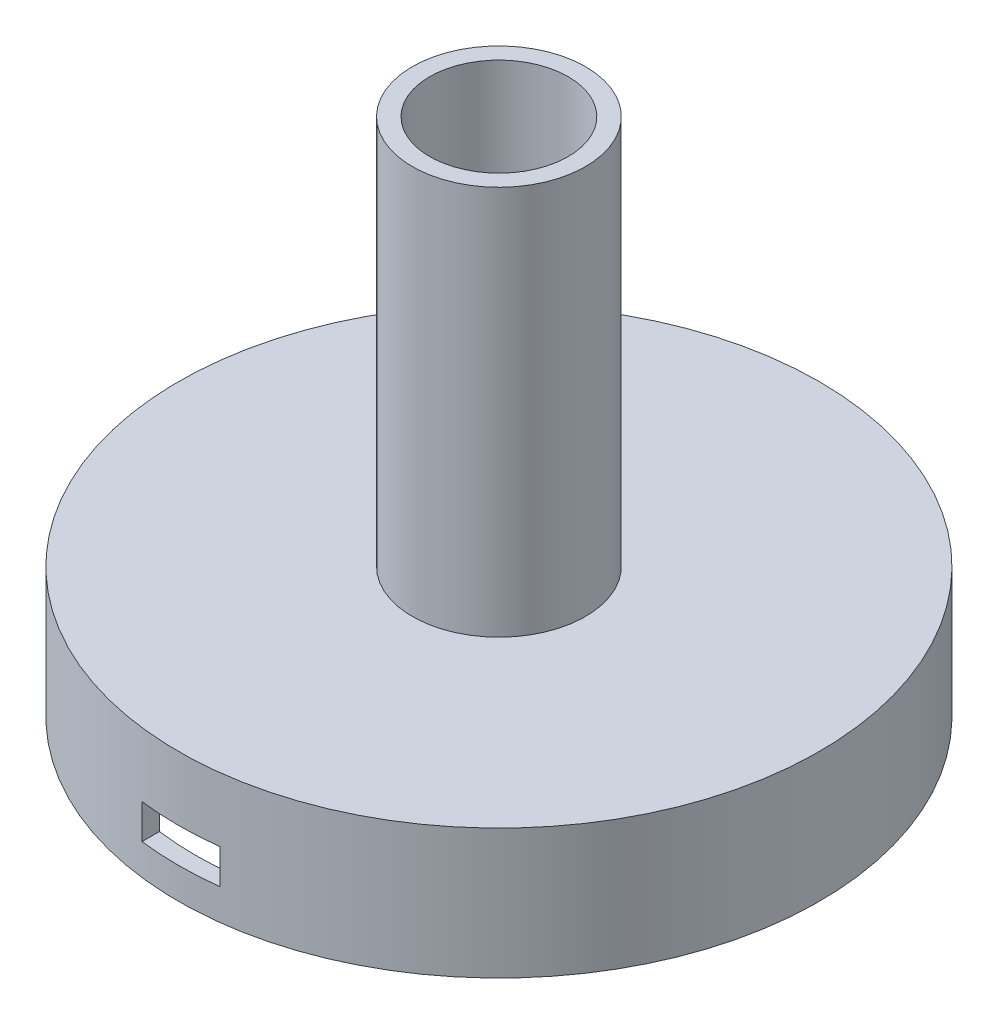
from build123d import *

# Parameters (mm, degrees)
SKETCH_2_W          = 9
SKETCH_2_H          = 4
CUT_EXTRUDE_1_DEPTH = 58
SKETCH_4_W          = 7
SKETCH_4_H          = 5
SKETCH_4_R          = 1.25
EXTRUDE_2_DEPTH     = 11


with BuildPart() as part:
    # Sketch 1 → Revolve 2 (revolve)
    with BuildSketch(Plane.XY, mode=Mode.PRIVATE) as revolve_2_sk:
        Polygon((-37, 0), (-37, 15), (-10, 15), (-10, 60), (-8, 60), (-8, 13), (-35, 13), (-35, 0), align=None)
    revolve(revolve_2_sk.sketch.rotate(Axis((0, 0, 0), (0, 1, 0)), 270), axis=Axis((0, 0, 0), (0, 1, 0)))

    # Sketch 2 → Cut-Extrude 1 (cut)
    with BuildSketch(Plane.XY):
        with Locations((0, 5.6)):
            Rectangle(SKETCH_2_W, SKETCH_2_H)
    extrude(amount=CUT_EXTRUDE_1_DEPTH, mode=Mode.SUBTRACT)

    # Sketch 4 → Extrude 2 (add)
    # profile 1 of 2: a face of its own
    with BuildSketch(Plane(origin=(0, 13, 0), x_dir=(-1, 0, 0), z_dir=(0, -1, 0))):
        with Locations((-31.401293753, -0.614992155)):
            Rectangle(SKETCH_4_W, SKETCH_4_H)
        with Locations(Location((-31.401293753, -0.614992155, 0), (0, 0, 270))):
            Circle(SKETCH_4_R, mode=Mode.SUBTRACT)
    # profile 2 of 2: a face of its own
    with BuildSketch(Plane(origin=(0, 13, 0), x_dir=(-1, 0, 0), z_dir=(0, -1, 0))):
        with Locations((31.401293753, -0.614992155)):
            Rectangle(SKETCH_4_W, SKETCH_4_H)
        with Locations(Location((31.401293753, -0.614992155, 0), (0, 0, 90))):
            Circle(SKETCH_4_R, mode=Mode.SUBTRACT)
    extrude(amount=EXTRUDE_2_DEPTH)


solid = part.part
